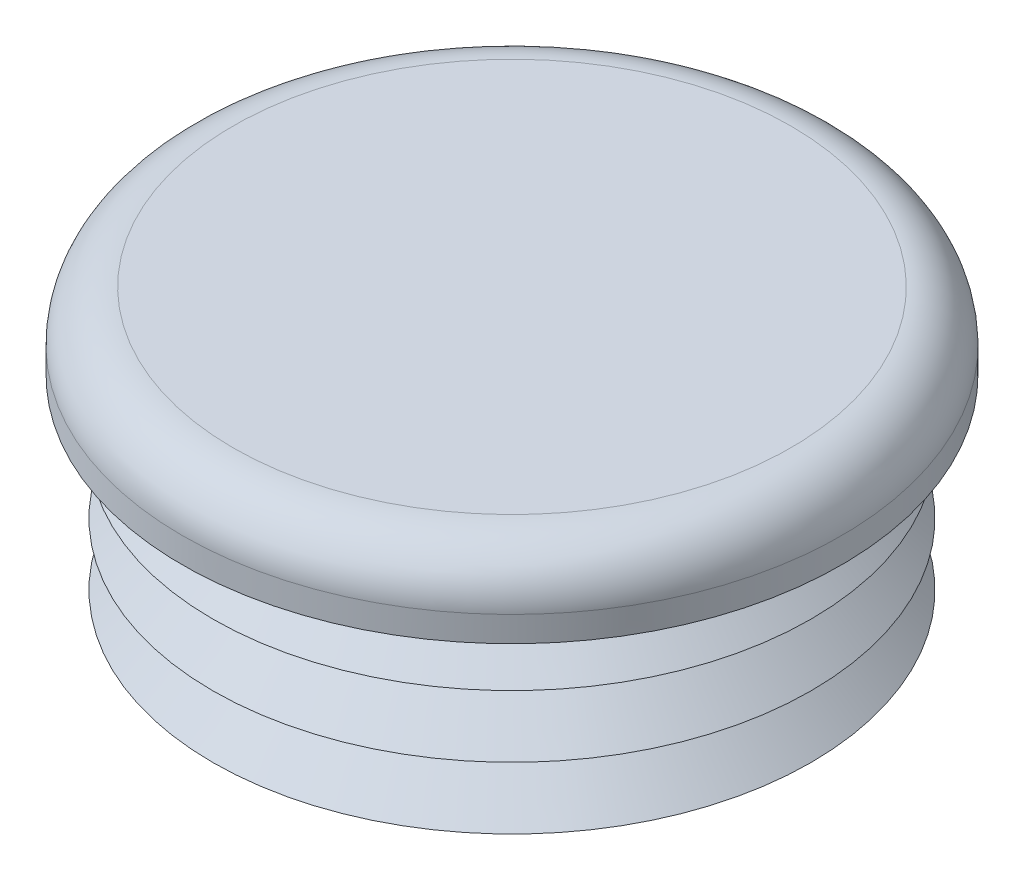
from build123d import *

# Parameters (mm, degrees)
FILLET1_R = 3.175


with BuildPart() as part:
    # Sketch1 → Revolve1 (revolve)
    with BuildSketch(Plane.XY, mode=Mode.PRIVATE) as revolve1_sk:
        Polygon((15.875, 0), (15.875, 1.031875), (18.7325, 1.031875), (15.875, 3.889375), (15.875, 4.92125), (18.7325, 4.92125), (15.875, 7.77875), (15.875, 8.810625), (18.7325, 8.810625), (15.875, 11.668125), (15.875, 12.7), (20.6375, 12.7), (20.6375, 17.4625), (0, 17.4625), (0, 12.7), (14.9225, 12.7), (14.9225, 0), align=None)
    revolve(revolve1_sk.sketch.rotate(Axis((0, 0, 0), (0, 1, 0)), 90), axis=Axis((0, 0, 0), (0, 1, 0)))

    # Fillet1
    fillet1_edges = [part.edges().sort_by_distance(p)[0] for p in [
        (0, 17.4625, 20.6375),
    ]]
    fillet(fillet1_edges, radius=FILLET1_R)


solid = part.part
